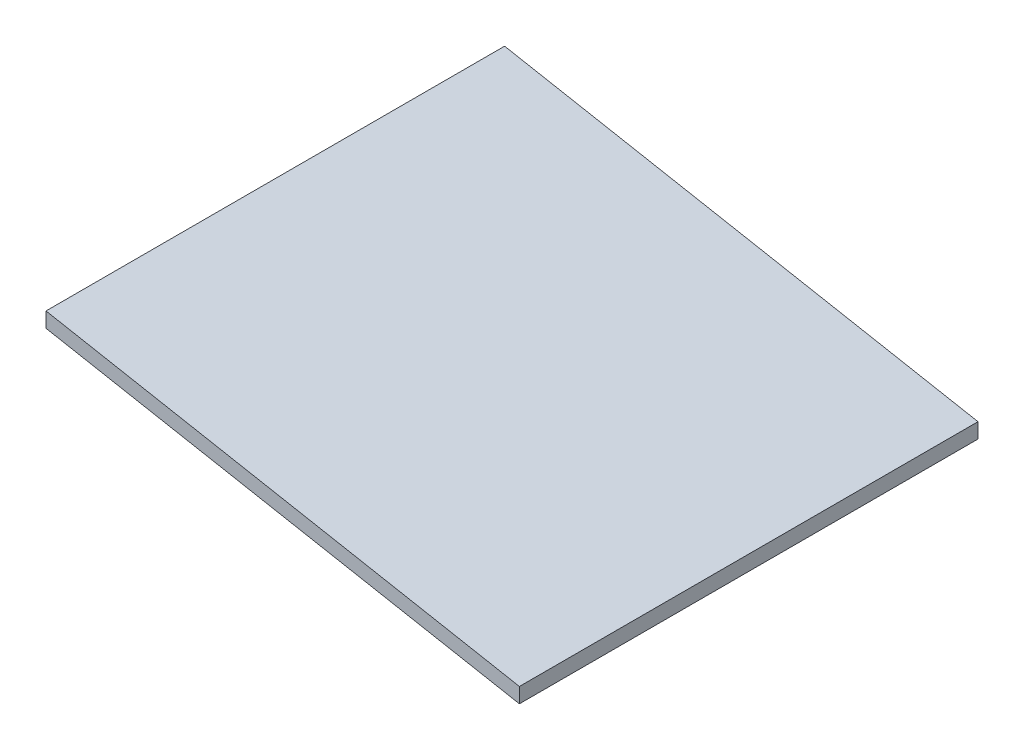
from build123d import *

# Parameters (mm, degrees)
EXTRUDE1_DEPTH      = 273.276081
EXTRUDE1_DEPTH_BACK = 120.423919


with BuildPart() as part:
    # Sketch3 → Extrude1 (new, two sides: drawn at the far end of the back side and taken through both)
    with BuildSketch(Plane(origin=(0, 0, -133.123918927), x_dir=(-1, 0, 0), z_dir=(0, 0, -1)).offset(-EXTRUDE1_DEPTH_BACK)):
        Polygon((-203.2, 247.870048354), (203.2, 323.85), (203.2, 310.929951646), (-203.2, 234.95), align=None)
    extrude(amount=EXTRUDE1_DEPTH + EXTRUDE1_DEPTH_BACK)


solid = part.part
